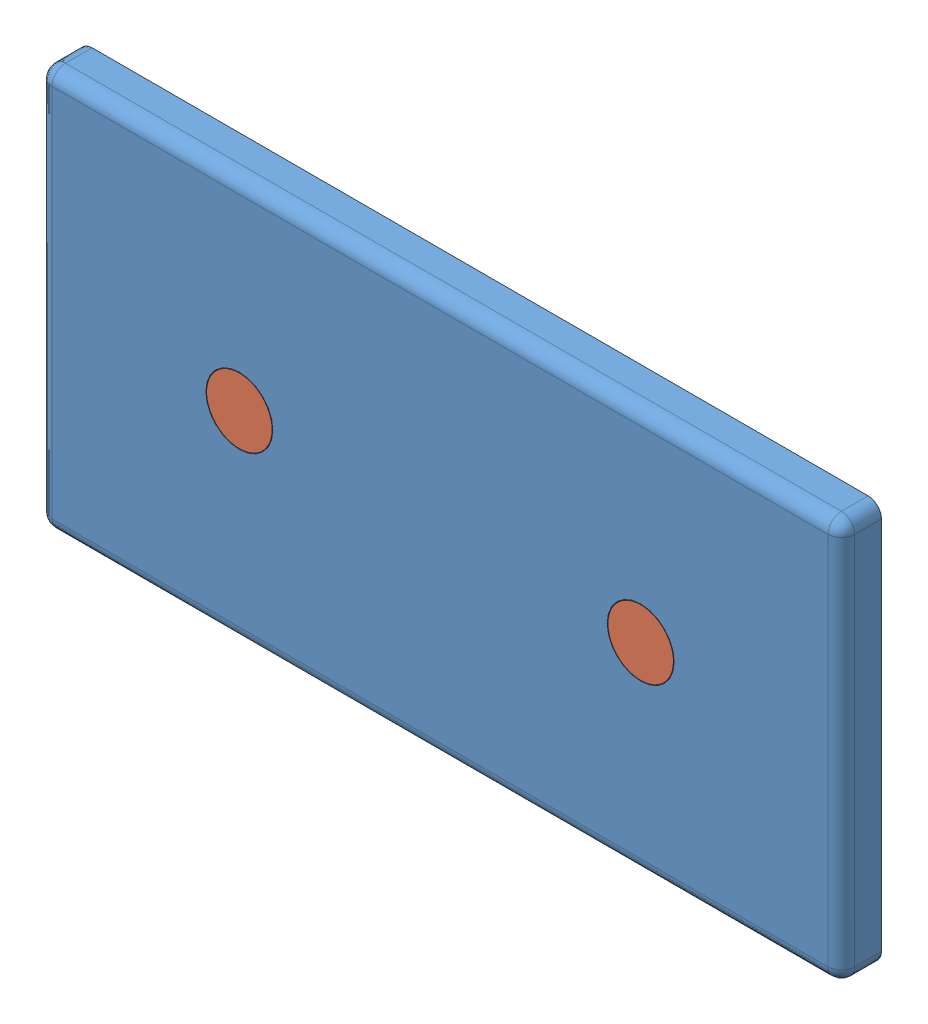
SolidWorks assembly 22.1134_1 End Cap 30x60 Gray.SLDASM, configuration Default (file format 3800). Lengths in mm.
Overall size (60 30 8.5).
3 component instances, 2 part files, 4 mates.
Components (placement in the parent):
- 22.1134_1 END CAP 30X60-1: 22.1134_1 END CAP 30X60.sldprt [Default] at origin size (60 30 8.5)
- END CAP DOWEL 30 GRAY-1: END CAP DOWEL 30 GRAY.sldprt [Default] at (-15 0 -4) x (-0.706891 0.707322 0) z (0 0 1) size (4.9 4.9 7)
- END CAP DOWEL 30 GRAY-2: END CAP DOWEL 30 GRAY.sldprt [Default] at (15 0 -4) x (-0.802259 0.596976 0) z (0 0 1) size (4.9 4.9 7)
Mates (geometry in assembly coordinates):
- Concentric1: concentric: cylinder of 22.1134_1 END CAP 30X60-1; cylinder of END CAP DOWEL 30 GRAY-1
- Coincident1: coincident: plane of 22.1134_1 END CAP 30X60-1 through (0 0 3) normal (0 0 1); plane of END CAP DOWEL 30 GRAY-1 through (-15 0 3) normal (0 0 1)
- Concentric2: concentric: cylinder of 22.1134_1 END CAP 30X60-1; cylinder of END CAP DOWEL 30 GRAY-2
- Coincident2: coincident: plane of 22.1134_1 END CAP 30X60-1 through (0 0 3) normal (0 0 1); plane of END CAP DOWEL 30 GRAY-2 through (15 0 3) normal (0 0 1)
